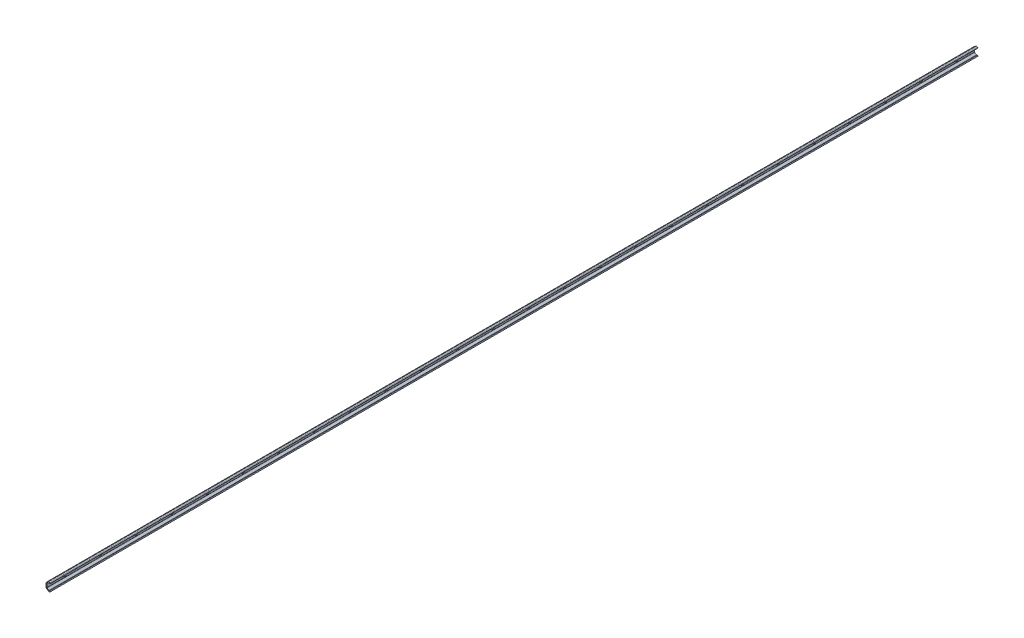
from build123d import *

# Parameters (mm, degrees)
EXTRUDE1_DEPTH  = 2080
EXTRUDE2_DEPTH  = 2081.037685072
LPATTERN1_COUNT = 26
LPATTERN1_PITCH = 80


with BuildPart() as part:
    # Sketch1 → Extrude1 (new body)
    with BuildSketch(Plane.XY):
        with BuildLine():
            Line((8.852847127, 6.521073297), (10, 8.159377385))
            Line((10, 8.159377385), (8.632108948, 9.117185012))
            ThreePointArc((8.632108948, 9.117185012), (7, 9.631786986), (5.367891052, 9.117185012))
            Line((5.367891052, 9.117185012), (1.382718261, 6.326736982))
            ThreePointArc((1.382718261, 6.326736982), (0.396073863, 5.224958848), (0, 3.8))
            Line((0, 3.8), (0, -3.8))
            ThreePointArc((0, -3.8), (0.368285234, -5.240165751), (1.382718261, -6.326736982))
            Line((1.382718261, -6.326736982), (5.367891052, -9.117185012))
            ThreePointArc((5.367891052, -9.117185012), (7, -9.631786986), (8.632108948, -9.117185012))
            Line((8.632108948, -9.117185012), (10, -8.159377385))
            Line((10, -8.159377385), (8.852847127, -6.521073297))
            Line((8.852847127, -6.521073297), (7.521966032, -7.452966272))
            ThreePointArc((7.521966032, -7.452966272), (7, -7.61754153), (6.478033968, -7.452966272))
            Line((6.478033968, -7.452966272), (2.369060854, -4.575832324))
            ThreePointArc((2.369060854, -4.575832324), (2.082184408, -4.236601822), (2, -3.8))
            Line((2, -3.8), (2, 3.8))
            ThreePointArc((2, 3.8), (2.096966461, 4.229570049), (2.369060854, 4.575832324))
            Line((2.369060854, 4.575832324), (6.478033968, 7.452966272))
            ThreePointArc((6.478033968, 7.452966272), (7, 7.61754153), (7.521966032, 7.452966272))
            Line((7.521966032, 7.452966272), (8.852847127, 6.521073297))
        make_face()
    extrude(amount=-EXTRUDE1_DEPTH)

    # Sketch2 → Extrude2 (cut, through all)
    with BuildSketch(Plane(origin=(2, 0, 0), x_dir=(0, 0, -1), z_dir=(1, 0, 0))):
        with BuildLine():
            Line((38.75, 2.25), (41.25, 2.25))
            ThreePointArc((41.25, 2.25), (43.5, 0), (41.25, -2.25))
            Line((41.25, -2.25), (38.75, -2.25))
            ThreePointArc((38.75, -2.25), (36.5, 0), (38.75, 2.25))
        make_face()
    extrude2 = extrude(amount=-EXTRUDE2_DEPTH, mode=Mode.SUBTRACT)

    # LPattern1: Extrude2 ×26
    with Locations(*[(0, 0, -i * LPATTERN1_PITCH) for i in range(1, LPATTERN1_COUNT)]):
        add(extrude2, mode=Mode.SUBTRACT)


solid = part.part
